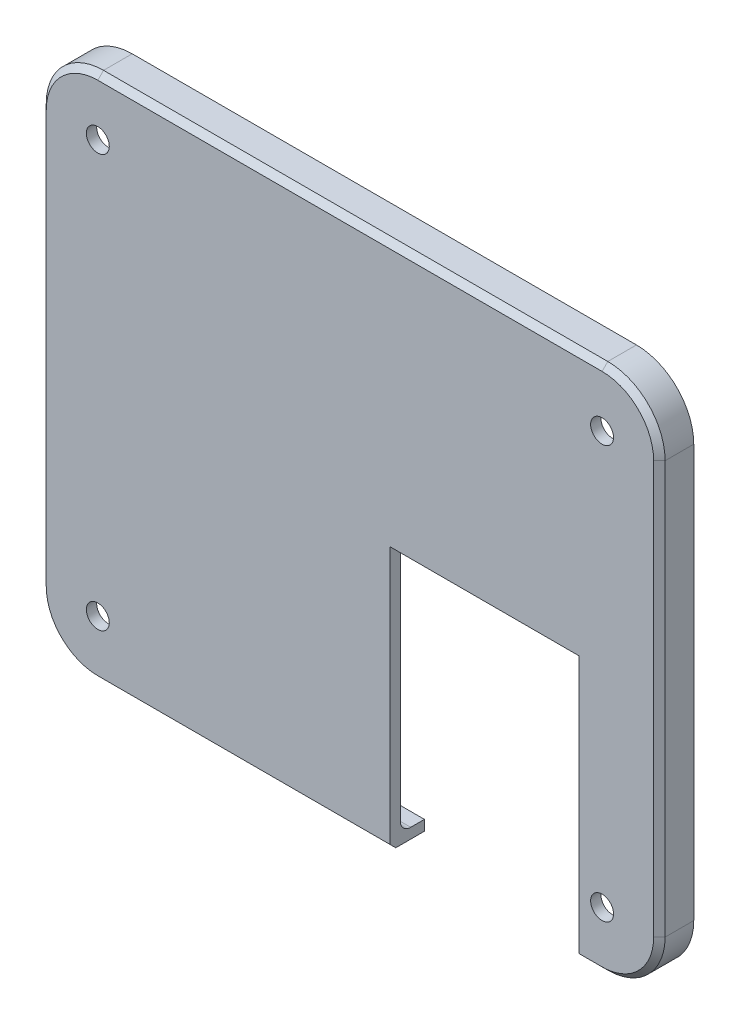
ISO-10303-21;
HEADER;
FILE_DESCRIPTION(('STEP AP214'),'2;1');
FILE_NAME('part.step','',(''),(''),'','','');
FILE_SCHEMA(('AUTOMOTIVE_DESIGN { 1 0 10303 214 1 1 1 1 }'));
ENDSEC;
DATA;
#1=APPLICATION_CONTEXT('core data for automotive mechanical design processes');
#2=APPLICATION_PROTOCOL_DEFINITION('international standard','automotive_design',2000,#1);
#3=PRODUCT_CONTEXT('',#1,'mechanical');
#4=PRODUCT('Part','Part','',(#3));
#5=PRODUCT_RELATED_PRODUCT_CATEGORY('part','',(#4));
#6=PRODUCT_DEFINITION_FORMATION('','',#4);
#7=PRODUCT_DEFINITION_CONTEXT('part definition',#1,'design');
#8=PRODUCT_DEFINITION('design','',#6,#7);
#9=PRODUCT_DEFINITION_SHAPE('','',#8);
#10=(LENGTH_UNIT() NAMED_UNIT(*) SI_UNIT(.MILLI.,.METRE.));
#11=(NAMED_UNIT(*) PLANE_ANGLE_UNIT() SI_UNIT($,.RADIAN.));
#12=(NAMED_UNIT(*) SI_UNIT($,.STERADIAN.) SOLID_ANGLE_UNIT());
#13=UNCERTAINTY_MEASURE_WITH_UNIT(LENGTH_MEASURE(1.E-05),#10,'distance_accuracy_value','');
#14=(GEOMETRIC_REPRESENTATION_CONTEXT(3) GLOBAL_UNCERTAINTY_ASSIGNED_CONTEXT((#13)) GLOBAL_UNIT_ASSIGNED_CONTEXT((#10,
#11,#12)) REPRESENTATION_CONTEXT('',''));
#15=CARTESIAN_POINT('',(0.,0.,0.));
#16=DIRECTION('',(0.,0.,1.));
#17=DIRECTION('',(1.,0.,0.));
#18=AXIS2_PLACEMENT_3D('',#15,#16,#17);
#19=CARTESIAN_POINT('',(44.0000000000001,-46.,6.));
#20=DIRECTION('',(0.,1.,0.));
#21=DIRECTION('',(0.,0.,1.));
#22=AXIS2_PLACEMENT_3D('',#19,#20,#21);
#23=PLANE('',#22);
#24=DIRECTION('',(0.,0.,1.));
#25=VECTOR('',#24,1.);
#26=CARTESIAN_POINT('',(7.00000000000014,-46.,0.));
#27=LINE('',#26,#25);
#28=CARTESIAN_POINT('',(7.00000000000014,-46.,0.));
#29=VERTEX_POINT('',#28);
#30=CARTESIAN_POINT('',(7.00000000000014,-46.,5.));
#31=VERTEX_POINT('',#30);
#32=EDGE_CURVE('E243',#29,#31,#27,.T.);
#33=ORIENTED_EDGE('',*,*,#32,.T.);
#34=DIRECTION('',(-1.,0.,0.));
#35=VECTOR('',#34,1.);
#36=CARTESIAN_POINT('',(-44.0000000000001,-46.,5.));
#37=LINE('',#36,#35);
#38=CARTESIAN_POINT('',(-44.0000000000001,-46.,5.));
#39=VERTEX_POINT('',#38);
#40=EDGE_CURVE('E343',#31,#39,#37,.T.);
#41=ORIENTED_EDGE('',*,*,#40,.T.);
#42=DIRECTION('',(0.,0.,-1.));
#43=VECTOR('',#42,1.);
#44=CARTESIAN_POINT('',(-44.0000000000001,-46.,6.));
#45=LINE('',#44,#43);
#46=CARTESIAN_POINT('',(-44.0000000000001,-46.,0.));
#47=VERTEX_POINT('',#46);
#48=EDGE_CURVE('E271',#39,#47,#45,.T.);
#49=ORIENTED_EDGE('',*,*,#48,.T.);
#50=DIRECTION('',(1.,0.,0.));
#51=VECTOR('',#50,1.);
#52=CARTESIAN_POINT('',(44.0000000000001,-46.,0.));
#53=LINE('',#52,#51);
#54=EDGE_CURVE('E263',#47,#29,#53,.T.);
#55=ORIENTED_EDGE('',*,*,#54,.T.);
#56=EDGE_LOOP('',(#33,#41,#49,#55));
#57=FACE_BOUND('',#56,.T.);
#58=ADVANCED_FACE('F33',(#57),#23,.F.);
#59=CARTESIAN_POINT('',(44.0000000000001,-44.2,6.));
#60=DIRECTION('',(0.,1.,0.));
#61=DIRECTION('',(0.,0.,1.));
#62=AXIS2_PLACEMENT_3D('',#59,#60,#61);
#63=PLANE('',#62);
#64=DIRECTION('',(0.,0.,1.));
#65=VECTOR('',#64,1.);
#66=CARTESIAN_POINT('',(-44.0000000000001,-44.2,6.));
#67=LINE('',#66,#65);
#68=CARTESIAN_POINT('',(-44.0000000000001,-44.2,2.4));
#69=VERTEX_POINT('',#68);
#70=CARTESIAN_POINT('',(-44.0000000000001,-44.2,0.));
#71=VERTEX_POINT('',#70);
#72=EDGE_CURVE('E454',#69,#71,#67,.F.);
#73=ORIENTED_EDGE('',*,*,#72,.F.);
#74=DIRECTION('',(1.,0.,0.));
#75=VECTOR('',#74,1.);
#76=CARTESIAN_POINT('',(44.0000000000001,-44.2,2.4));
#77=LINE('',#76,#75);
#78=CARTESIAN_POINT('',(7.00000000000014,-44.2,2.4));
#79=VERTEX_POINT('',#78);
#80=EDGE_CURVE('E410',#69,#79,#77,.T.);
#81=ORIENTED_EDGE('',*,*,#80,.T.);
#82=DIRECTION('',(0.,0.,1.));
#83=VECTOR('',#82,1.);
#84=CARTESIAN_POINT('',(7.00000000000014,-44.2,6.));
#85=LINE('',#84,#83);
#86=CARTESIAN_POINT('',(7.00000000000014,-44.2,0.));
#87=VERTEX_POINT('',#86);
#88=EDGE_CURVE('E314',#87,#79,#85,.T.);
#89=ORIENTED_EDGE('',*,*,#88,.F.);
#90=DIRECTION('',(1.,0.,0.));
#91=VECTOR('',#90,1.);
#92=CARTESIAN_POINT('',(44.0000000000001,-44.2,0.));
#93=LINE('',#92,#91);
#94=EDGE_CURVE('E267',#71,#87,#93,.T.);
#95=ORIENTED_EDGE('',*,*,#94,.F.);
#96=EDGE_LOOP('',(#73,#81,#89,#95));
#97=FACE_BOUND('',#96,.T.);
#98=ADVANCED_FACE('F453',(#97),#63,.T.);
#99=CARTESIAN_POINT('',(-44.0000000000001,-36.,6.));
#100=DIRECTION('',(0.,0.,1.));
#101=DIRECTION('',(1.,0.,0.));
#102=AXIS2_PLACEMENT_3D('',#99,#100,#101);
#103=PLANE('',#102);
#104=DIRECTION('',(0.,1.,0.));
#105=VECTOR('',#104,1.);
#106=CARTESIAN_POINT('',(40.0000000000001,-46.,6.));
#107=LINE('',#106,#105);
#108=CARTESIAN_POINT('',(40.0000000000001,-45.,6.));
#109=VERTEX_POINT('',#108);
#110=CARTESIAN_POINT('',(40.0000000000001,0.,6.));
#111=VERTEX_POINT('',#110);
#112=EDGE_CURVE('E585',#109,#111,#107,.T.);
#113=ORIENTED_EDGE('',*,*,#112,.F.);
#114=DIRECTION('',(1.,0.,0.));
#115=VECTOR('',#114,1.);
#116=CARTESIAN_POINT('',(44.0000000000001,-45.,6.));
#117=LINE('',#116,#115);
#118=CARTESIAN_POINT('',(44.0000000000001,-45.,6.));
#119=VERTEX_POINT('',#118);
#120=EDGE_CURVE('E335',#109,#119,#117,.T.);
#121=ORIENTED_EDGE('',*,*,#120,.T.);
#122=CARTESIAN_POINT('',(44.0000000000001,-36.,6.));
#123=DIRECTION('',(0.,0.,1.));
#124=DIRECTION('',(1.,0.,0.));
#125=AXIS2_PLACEMENT_3D('',#122,#123,#124);
#126=CIRCLE('',#125,9.);
#127=CARTESIAN_POINT('',(53.0000000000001,-36.,6.));
#128=VERTEX_POINT('',#127);
#129=EDGE_CURVE('E331',#119,#128,#126,.T.);
#130=ORIENTED_EDGE('',*,*,#129,.T.);
#131=DIRECTION('',(0.,1.,0.));
#132=VECTOR('',#131,1.);
#133=CARTESIAN_POINT('',(53.0000000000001,36.,6.));
#134=LINE('',#133,#132);
#135=CARTESIAN_POINT('',(53.0000000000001,36.,6.));
#136=VERTEX_POINT('',#135);
#137=EDGE_CURVE('E327',#128,#136,#134,.T.);
#138=ORIENTED_EDGE('',*,*,#137,.T.);
#139=CARTESIAN_POINT('',(44.0000000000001,36.,6.));
#140=DIRECTION('',(0.,0.,1.));
#141=DIRECTION('',(1.,0.,0.));
#142=AXIS2_PLACEMENT_3D('',#139,#140,#141);
#143=CIRCLE('',#142,8.99999999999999);
#144=CARTESIAN_POINT('',(44.0000000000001,45.,6.));
#145=VERTEX_POINT('',#144);
#146=EDGE_CURVE('E323',#136,#145,#143,.T.);
#147=ORIENTED_EDGE('',*,*,#146,.T.);
#148=DIRECTION('',(-1.,0.,0.));
#149=VECTOR('',#148,1.);
#150=CARTESIAN_POINT('',(-44.0000000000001,45.,6.));
#151=LINE('',#150,#149);
#152=CARTESIAN_POINT('',(-44.0000000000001,45.,6.));
#153=VERTEX_POINT('',#152);
#154=EDGE_CURVE('E319',#145,#153,#151,.T.);
#155=ORIENTED_EDGE('',*,*,#154,.T.);
#156=CARTESIAN_POINT('',(-44.0000000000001,36.,6.));
#157=DIRECTION('',(0.,0.,1.));
#158=DIRECTION('',(1.,0.,0.));
#159=AXIS2_PLACEMENT_3D('',#156,#157,#158);
#160=CIRCLE('',#159,8.99999999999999);
#161=CARTESIAN_POINT('',(-53.0000000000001,36.,6.));
#162=VERTEX_POINT('',#161);
#163=EDGE_CURVE('E321',#153,#162,#160,.T.);
#164=ORIENTED_EDGE('',*,*,#163,.T.);
#165=DIRECTION('',(0.,-1.,0.));
#166=VECTOR('',#165,1.);
#167=CARTESIAN_POINT('',(-53.0000000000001,-36.,6.));
#168=LINE('',#167,#166);
#169=CARTESIAN_POINT('',(-53.0000000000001,-36.,6.));
#170=VERTEX_POINT('',#169);
#171=EDGE_CURVE('E325',#162,#170,#168,.T.);
#172=ORIENTED_EDGE('',*,*,#171,.T.);
#173=CARTESIAN_POINT('',(-44.0000000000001,-36.,6.));
#174=DIRECTION('',(0.,0.,1.));
#175=DIRECTION('',(1.,0.,0.));
#176=AXIS2_PLACEMENT_3D('',#173,#174,#175);
#177=CIRCLE('',#176,9.);
#178=CARTESIAN_POINT('',(-44.0000000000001,-45.,6.));
#179=VERTEX_POINT('',#178);
#180=EDGE_CURVE('E329',#170,#179,#177,.T.);
#181=ORIENTED_EDGE('',*,*,#180,.T.);
#182=DIRECTION('',(1.,0.,0.));
#183=VECTOR('',#182,1.);
#184=CARTESIAN_POINT('',(7.00000000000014,-45.,6.));
#185=LINE('',#184,#183);
#186=CARTESIAN_POINT('',(7.00000000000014,-45.,6.));
#187=VERTEX_POINT('',#186);
#188=EDGE_CURVE('E333',#179,#187,#185,.T.);
#189=ORIENTED_EDGE('',*,*,#188,.T.);
#190=DIRECTION('',(0.,-1.,0.));
#191=VECTOR('',#190,1.);
#192=CARTESIAN_POINT('',(7.00000000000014,-46.,6.));
#193=LINE('',#192,#191);
#194=CARTESIAN_POINT('',(7.00000000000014,0.,6.));
#195=VERTEX_POINT('',#194);
#196=EDGE_CURVE('E383',#195,#187,#193,.T.);
#197=ORIENTED_EDGE('',*,*,#196,.F.);
#198=DIRECTION('',(-1.,0.,0.));
#199=VECTOR('',#198,1.);
#200=CARTESIAN_POINT('',(7.00000000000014,0.,6.));
#201=LINE('',#200,#199);
#202=EDGE_CURVE('E268',#111,#195,#201,.T.);
#203=ORIENTED_EDGE('',*,*,#202,.F.);
#204=EDGE_LOOP('',(#113,#121,#130,#138,#147,#155,#164,#172,#181,#189,#197,#203));
#205=FACE_BOUND('',#204,.T.);
#206=CARTESIAN_POINT('',(43.9999999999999,36.,6.));
#207=DIRECTION('',(0.,0.,1.));
#208=DIRECTION('',(1.,0.,0.));
#209=AXIS2_PLACEMENT_3D('',#206,#207,#208);
#210=CIRCLE('',#209,2.);
#211=CARTESIAN_POINT('',(45.9999999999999,36.,6.));
#212=VERTEX_POINT('',#211);
#213=EDGE_CURVE('E519',#212,#212,#210,.T.);
#214=ORIENTED_EDGE('',*,*,#213,.F.);
#215=EDGE_LOOP('',(#214));
#216=FACE_BOUND('',#215,.T.);
#217=CARTESIAN_POINT('',(-43.9999999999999,-36.,6.));
#218=DIRECTION('',(0.,0.,1.));
#219=DIRECTION('',(1.,0.,0.));
#220=AXIS2_PLACEMENT_3D('',#217,#218,#219);
#221=CIRCLE('',#220,2.);
#222=CARTESIAN_POINT('',(-41.9999999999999,-36.,6.));
#223=VERTEX_POINT('',#222);
#224=EDGE_CURVE('E524',#223,#223,#221,.T.);
#225=ORIENTED_EDGE('',*,*,#224,.F.);
#226=EDGE_LOOP('',(#225));
#227=FACE_BOUND('',#226,.T.);
#228=CARTESIAN_POINT('',(44.0000000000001,-36.,6.));
#229=DIRECTION('',(0.,0.,1.));
#230=DIRECTION('',(1.,0.,0.));
#231=AXIS2_PLACEMENT_3D('',#228,#229,#230);
#232=CIRCLE('',#231,2.);
#233=CARTESIAN_POINT('',(46.0000000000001,-36.,6.));
#234=VERTEX_POINT('',#233);
#235=EDGE_CURVE('E522',#234,#234,#232,.T.);
#236=ORIENTED_EDGE('',*,*,#235,.F.);
#237=EDGE_LOOP('',(#236));
#238=FACE_BOUND('',#237,.T.);
#239=CARTESIAN_POINT('',(-44.0000000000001,36.,6.));
#240=DIRECTION('',(0.,0.,1.));
#241=DIRECTION('',(1.,0.,0.));
#242=AXIS2_PLACEMENT_3D('',#239,#240,#241);
#243=CIRCLE('',#242,2.);
#244=CARTESIAN_POINT('',(-42.0000000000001,36.,6.));
#245=VERTEX_POINT('',#244);
#246=EDGE_CURVE('E472',#245,#245,#243,.T.);
#247=ORIENTED_EDGE('',*,*,#246,.F.);
#248=EDGE_LOOP('',(#247));
#249=FACE_BOUND('',#248,.T.);
#250=ADVANCED_FACE('F625',(#205,#216,#227,#238,#249),#103,.T.);
#251=CARTESIAN_POINT('',(-44.0000000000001,-36.,0.));
#252=DIRECTION('',(0.,0.,1.));
#253=DIRECTION('',(1.,0.,0.));
#254=AXIS2_PLACEMENT_3D('',#251,#252,#253);
#255=PLANE('',#254);
#256=ORIENTED_EDGE('',*,*,#94,.T.);
#257=DIRECTION('',(0.,-1.,0.));
#258=VECTOR('',#257,1.);
#259=CARTESIAN_POINT('',(7.00000000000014,-46.,0.));
#260=LINE('',#259,#258);
#261=EDGE_CURVE('E248',#87,#29,#260,.T.);
#262=ORIENTED_EDGE('',*,*,#261,.T.);
#263=ORIENTED_EDGE('',*,*,#54,.F.);
#264=CARTESIAN_POINT('',(-44.0000000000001,-36.,0.));
#265=DIRECTION('',(0.,0.,1.));
#266=DIRECTION('',(1.,0.,0.));
#267=AXIS2_PLACEMENT_3D('',#264,#265,#266);
#268=CIRCLE('',#267,10.);
#269=CARTESIAN_POINT('',(-54.0000000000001,-36.,0.));
#270=VERTEX_POINT('',#269);
#271=EDGE_CURVE('E279',#270,#47,#268,.T.);
#272=ORIENTED_EDGE('',*,*,#271,.F.);
#273=DIRECTION('',(0.,-1.,0.));
#274=VECTOR('',#273,1.);
#275=CARTESIAN_POINT('',(-54.0000000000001,-36.,0.));
#276=LINE('',#275,#274);
#277=CARTESIAN_POINT('',(-54.0000000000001,36.,0.));
#278=VERTEX_POINT('',#277);
#279=EDGE_CURVE('E294',#278,#270,#276,.T.);
#280=ORIENTED_EDGE('',*,*,#279,.F.);
#281=CARTESIAN_POINT('',(-44.0000000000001,36.,0.));
#282=DIRECTION('',(0.,0.,1.));
#283=DIRECTION('',(1.,0.,0.));
#284=AXIS2_PLACEMENT_3D('',#281,#282,#283);
#285=CIRCLE('',#284,10.);
#286=CARTESIAN_POINT('',(-44.0000000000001,46.,0.));
#287=VERTEX_POINT('',#286);
#288=EDGE_CURVE('E291',#287,#278,#285,.T.);
#289=ORIENTED_EDGE('',*,*,#288,.F.);
#290=DIRECTION('',(-1.,0.,0.));
#291=VECTOR('',#290,1.);
#292=CARTESIAN_POINT('',(44.0000000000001,46.,0.));
#293=LINE('',#292,#291);
#294=CARTESIAN_POINT('',(44.0000000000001,46.,0.));
#295=VERTEX_POINT('',#294);
#296=EDGE_CURVE('E288',#295,#287,#293,.T.);
#297=ORIENTED_EDGE('',*,*,#296,.F.);
#298=CARTESIAN_POINT('',(44.0000000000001,36.,0.));
#299=DIRECTION('',(0.,0.,1.));
#300=DIRECTION('',(1.,0.,0.));
#301=AXIS2_PLACEMENT_3D('',#298,#299,#300);
#302=CIRCLE('',#301,10.);
#303=CARTESIAN_POINT('',(54.0000000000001,36.,0.));
#304=VERTEX_POINT('',#303);
#305=EDGE_CURVE('E285',#304,#295,#302,.T.);
#306=ORIENTED_EDGE('',*,*,#305,.F.);
#307=DIRECTION('',(0.,1.,0.));
#308=VECTOR('',#307,1.);
#309=CARTESIAN_POINT('',(54.0000000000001,-36.,0.));
#310=LINE('',#309,#308);
#311=CARTESIAN_POINT('',(54.0000000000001,-36.,0.));
#312=VERTEX_POINT('',#311);
#313=EDGE_CURVE('E276',#312,#304,#310,.T.);
#314=ORIENTED_EDGE('',*,*,#313,.F.);
#315=CARTESIAN_POINT('',(44.0000000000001,-36.,0.));
#316=DIRECTION('',(0.,0.,1.));
#317=DIRECTION('',(1.,0.,0.));
#318=AXIS2_PLACEMENT_3D('',#315,#316,#317);
#319=CIRCLE('',#318,10.);
#320=CARTESIAN_POINT('',(44.0000000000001,-46.,0.));
#321=VERTEX_POINT('',#320);
#322=EDGE_CURVE('E272',#321,#312,#319,.T.);
#323=ORIENTED_EDGE('',*,*,#322,.F.);
#324=CARTESIAN_POINT('',(40.0000000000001,-46.,0.));
#325=VERTEX_POINT('',#324);
#326=EDGE_CURVE('E273',#325,#321,#53,.T.);
#327=ORIENTED_EDGE('',*,*,#326,.F.);
#328=DIRECTION('',(0.,1.,0.));
#329=VECTOR('',#328,1.);
#330=CARTESIAN_POINT('',(40.0000000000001,-46.,0.));
#331=LINE('',#330,#329);
#332=CARTESIAN_POINT('',(40.0000000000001,-44.2,0.));
#333=VERTEX_POINT('',#332);
#334=EDGE_CURVE('E256',#325,#333,#331,.T.);
#335=ORIENTED_EDGE('',*,*,#334,.T.);
#336=CARTESIAN_POINT('',(44.0000000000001,-44.2,0.));
#337=VERTEX_POINT('',#336);
#338=EDGE_CURVE('E498',#333,#337,#93,.T.);
#339=ORIENTED_EDGE('',*,*,#338,.T.);
#340=CARTESIAN_POINT('',(44.0000000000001,-36.,0.));
#341=DIRECTION('',(0.,0.,1.));
#342=DIRECTION('',(1.,0.,0.));
#343=AXIS2_PLACEMENT_3D('',#340,#341,#342);
#344=CIRCLE('',#343,8.2);
#345=CARTESIAN_POINT('',(52.2000000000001,-36.,0.));
#346=VERTEX_POINT('',#345);
#347=EDGE_CURVE('E513',#337,#346,#344,.T.);
#348=ORIENTED_EDGE('',*,*,#347,.T.);
#349=DIRECTION('',(0.,1.,0.));
#350=VECTOR('',#349,1.);
#351=CARTESIAN_POINT('',(52.2000000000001,-36.,0.));
#352=LINE('',#351,#350);
#353=CARTESIAN_POINT('',(52.2000000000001,36.,0.));
#354=VERTEX_POINT('',#353);
#355=EDGE_CURVE('E510',#346,#354,#352,.T.);
#356=ORIENTED_EDGE('',*,*,#355,.T.);
#357=CARTESIAN_POINT('',(44.0000000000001,36.,0.));
#358=DIRECTION('',(0.,0.,1.));
#359=DIRECTION('',(1.,0.,0.));
#360=AXIS2_PLACEMENT_3D('',#357,#358,#359);
#361=CIRCLE('',#360,8.2);
#362=CARTESIAN_POINT('',(44.0000000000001,44.2,0.));
#363=VERTEX_POINT('',#362);
#364=EDGE_CURVE('E507',#354,#363,#361,.T.);
#365=ORIENTED_EDGE('',*,*,#364,.T.);
#366=DIRECTION('',(-1.,0.,0.));
#367=VECTOR('',#366,1.);
#368=CARTESIAN_POINT('',(44.0000000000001,44.2,0.));
#369=LINE('',#368,#367);
#370=CARTESIAN_POINT('',(-44.0000000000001,44.2,0.));
#371=VERTEX_POINT('',#370);
#372=EDGE_CURVE('E504',#363,#371,#369,.T.);
#373=ORIENTED_EDGE('',*,*,#372,.T.);
#374=CARTESIAN_POINT('',(-44.0000000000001,36.,0.));
#375=DIRECTION('',(0.,0.,1.));
#376=DIRECTION('',(1.,0.,0.));
#377=AXIS2_PLACEMENT_3D('',#374,#375,#376);
#378=CIRCLE('',#377,8.2);
#379=CARTESIAN_POINT('',(-52.2000000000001,36.,0.));
#380=VERTEX_POINT('',#379);
#381=EDGE_CURVE('E501',#371,#380,#378,.T.);
#382=ORIENTED_EDGE('',*,*,#381,.T.);
#383=DIRECTION('',(0.,-1.,0.));
#384=VECTOR('',#383,1.);
#385=CARTESIAN_POINT('',(-52.2000000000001,-36.,0.));
#386=LINE('',#385,#384);
#387=CARTESIAN_POINT('',(-52.2000000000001,-36.,0.));
#388=VERTEX_POINT('',#387);
#389=EDGE_CURVE('E477',#380,#388,#386,.T.);
#390=ORIENTED_EDGE('',*,*,#389,.T.);
#391=CARTESIAN_POINT('',(-44.0000000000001,-36.,0.));
#392=DIRECTION('',(0.,0.,1.));
#393=DIRECTION('',(1.,0.,0.));
#394=AXIS2_PLACEMENT_3D('',#391,#392,#393);
#395=CIRCLE('',#394,8.20000000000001);
#396=EDGE_CURVE('E494',#388,#71,#395,.T.);
#397=ORIENTED_EDGE('',*,*,#396,.T.);
#398=EDGE_LOOP('',(#256,#262,#263,#272,#280,#289,#297,#306,#314,#323,#327,#335,#339,#348,#356,
#365,#373,#382,#390,#397));
#399=FACE_BOUND('',#398,.T.);
#400=ADVANCED_FACE('F261',(#399),#255,.F.);
#401=CARTESIAN_POINT('',(-44.0000000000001,-36.,6.));
#402=DIRECTION('',(0.,0.,-1.));
#403=DIRECTION('',(-1.,0.,0.));
#404=AXIS2_PLACEMENT_3D('',#401,#402,#403);
#405=CYLINDRICAL_SURFACE('',#404,10.);
#406=ORIENTED_EDGE('',*,*,#48,.F.);
#407=CARTESIAN_POINT('',(-44.0000000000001,-36.,5.));
#408=DIRECTION('',(0.,0.,1.));
#409=DIRECTION('',(1.,0.,0.));
#410=AXIS2_PLACEMENT_3D('',#407,#408,#409);
#411=CIRCLE('',#410,10.);
#412=CARTESIAN_POINT('',(-54.0000000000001,-36.,5.));
#413=VERTEX_POINT('',#412);
#414=EDGE_CURVE('E347',#39,#413,#411,.F.);
#415=ORIENTED_EDGE('',*,*,#414,.T.);
#416=DIRECTION('',(0.,0.,-1.));
#417=VECTOR('',#416,1.);
#418=CARTESIAN_POINT('',(-54.0000000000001,-36.,6.));
#419=LINE('',#418,#417);
#420=EDGE_CURVE('E297',#413,#270,#419,.T.);
#421=ORIENTED_EDGE('',*,*,#420,.T.);
#422=ORIENTED_EDGE('',*,*,#271,.T.);
#423=EDGE_LOOP('',(#406,#415,#421,#422));
#424=FACE_BOUND('',#423,.T.);
#425=ADVANCED_FACE('F529',(#424),#405,.T.);
#426=DIRECTION('',(0.,0.,-1.));
#427=VECTOR('',#426,1.);
#428=CARTESIAN_POINT('',(44.0000000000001,-46.,6.));
#429=LINE('',#428,#427);
#430=CARTESIAN_POINT('',(44.0000000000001,-46.,5.));
#431=VERTEX_POINT('',#430);
#432=EDGE_CURVE('E309',#431,#321,#429,.T.);
#433=ORIENTED_EDGE('',*,*,#432,.F.);
#434=DIRECTION('',(-1.,0.,0.));
#435=VECTOR('',#434,1.);
#436=CARTESIAN_POINT('',(40.0000000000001,-46.,5.));
#437=LINE('',#436,#435);
#438=CARTESIAN_POINT('',(40.0000000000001,-46.,5.));
#439=VERTEX_POINT('',#438);
#440=EDGE_CURVE('E338',#431,#439,#437,.T.);
#441=ORIENTED_EDGE('',*,*,#440,.T.);
#442=DIRECTION('',(0.,0.,1.));
#443=VECTOR('',#442,1.);
#444=CARTESIAN_POINT('',(40.0000000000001,-46.,0.));
#445=LINE('',#444,#443);
#446=EDGE_CURVE('E255',#325,#439,#445,.T.);
#447=ORIENTED_EDGE('',*,*,#446,.F.);
#448=ORIENTED_EDGE('',*,*,#326,.T.);
#449=EDGE_LOOP('',(#433,#441,#447,#448));
#450=FACE_BOUND('',#449,.T.);
#451=ADVANCED_FACE('F572',(#450),#23,.F.);
#452=CARTESIAN_POINT('',(44.0000000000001,-36.,6.));
#453=DIRECTION('',(0.,0.,-1.));
#454=DIRECTION('',(-1.,0.,0.));
#455=AXIS2_PLACEMENT_3D('',#452,#453,#454);
#456=CYLINDRICAL_SURFACE('',#455,10.);
#457=DIRECTION('',(0.,0.,-1.));
#458=VECTOR('',#457,1.);
#459=CARTESIAN_POINT('',(54.0000000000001,-36.,6.));
#460=LINE('',#459,#458);
#461=CARTESIAN_POINT('',(54.0000000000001,-36.,5.));
#462=VERTEX_POINT('',#461);
#463=EDGE_CURVE('E307',#462,#312,#460,.T.);
#464=ORIENTED_EDGE('',*,*,#463,.F.);
#465=CARTESIAN_POINT('',(44.0000000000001,-36.,5.));
#466=DIRECTION('',(0.,0.,1.));
#467=DIRECTION('',(1.,0.,0.));
#468=AXIS2_PLACEMENT_3D('',#465,#466,#467);
#469=CIRCLE('',#468,10.);
#470=EDGE_CURVE('E345',#462,#431,#469,.F.);
#471=ORIENTED_EDGE('',*,*,#470,.T.);
#472=ORIENTED_EDGE('',*,*,#432,.T.);
#473=ORIENTED_EDGE('',*,*,#322,.T.);
#474=EDGE_LOOP('',(#464,#471,#472,#473));
#475=FACE_BOUND('',#474,.T.);
#476=ADVANCED_FACE('F564',(#475),#456,.T.);
#477=CARTESIAN_POINT('',(54.0000000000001,-36.,6.));
#478=DIRECTION('',(-1.,0.,0.));
#479=DIRECTION('',(0.,0.,1.));
#480=AXIS2_PLACEMENT_3D('',#477,#478,#479);
#481=PLANE('',#480);
#482=DIRECTION('',(0.,0.,-1.));
#483=VECTOR('',#482,1.);
#484=CARTESIAN_POINT('',(54.0000000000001,36.,6.));
#485=LINE('',#484,#483);
#486=CARTESIAN_POINT('',(54.0000000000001,36.,5.));
#487=VERTEX_POINT('',#486);
#488=EDGE_CURVE('E305',#487,#304,#485,.T.);
#489=ORIENTED_EDGE('',*,*,#488,.F.);
#490=DIRECTION('',(0.,-1.,0.));
#491=VECTOR('',#490,1.);
#492=CARTESIAN_POINT('',(54.0000000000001,-36.,5.));
#493=LINE('',#492,#491);
#494=EDGE_CURVE('E349',#487,#462,#493,.T.);
#495=ORIENTED_EDGE('',*,*,#494,.T.);
#496=ORIENTED_EDGE('',*,*,#463,.T.);
#497=ORIENTED_EDGE('',*,*,#313,.T.);
#498=EDGE_LOOP('',(#489,#495,#496,#497));
#499=FACE_BOUND('',#498,.T.);
#500=ADVANCED_FACE('F559',(#499),#481,.F.);
#501=CARTESIAN_POINT('',(44.0000000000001,36.,6.));
#502=DIRECTION('',(0.,0.,-1.));
#503=DIRECTION('',(-1.,0.,0.));
#504=AXIS2_PLACEMENT_3D('',#501,#502,#503);
#505=CYLINDRICAL_SURFACE('',#504,10.);
#506=DIRECTION('',(0.,0.,-1.));
#507=VECTOR('',#506,1.);
#508=CARTESIAN_POINT('',(44.0000000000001,46.,6.));
#509=LINE('',#508,#507);
#510=CARTESIAN_POINT('',(44.0000000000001,46.,5.));
#511=VERTEX_POINT('',#510);
#512=EDGE_CURVE('E303',#511,#295,#509,.T.);
#513=ORIENTED_EDGE('',*,*,#512,.F.);
#514=CARTESIAN_POINT('',(44.0000000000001,36.,5.));
#515=DIRECTION('',(0.,0.,1.));
#516=DIRECTION('',(1.,0.,0.));
#517=AXIS2_PLACEMENT_3D('',#514,#515,#516);
#518=CIRCLE('',#517,10.);
#519=EDGE_CURVE('E353',#511,#487,#518,.F.);
#520=ORIENTED_EDGE('',*,*,#519,.T.);
#521=ORIENTED_EDGE('',*,*,#488,.T.);
#522=ORIENTED_EDGE('',*,*,#305,.T.);
#523=EDGE_LOOP('',(#513,#520,#521,#522));
#524=FACE_BOUND('',#523,.T.);
#525=ADVANCED_FACE('F553',(#524),#505,.T.);
#526=CARTESIAN_POINT('',(44.0000000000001,46.,6.));
#527=DIRECTION('',(0.,-1.,0.));
#528=DIRECTION('',(0.,0.,-1.));
#529=AXIS2_PLACEMENT_3D('',#526,#527,#528);
#530=PLANE('',#529);
#531=DIRECTION('',(0.,0.,-1.));
#532=VECTOR('',#531,1.);
#533=CARTESIAN_POINT('',(-44.0000000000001,46.,6.));
#534=LINE('',#533,#532);
#535=CARTESIAN_POINT('',(-44.0000000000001,46.,5.));
#536=VERTEX_POINT('',#535);
#537=EDGE_CURVE('E301',#536,#287,#534,.T.);
#538=ORIENTED_EDGE('',*,*,#537,.F.);
#539=DIRECTION('',(1.,0.,0.));
#540=VECTOR('',#539,1.);
#541=CARTESIAN_POINT('',(44.0000000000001,46.,5.));
#542=LINE('',#541,#540);
#543=EDGE_CURVE('E357',#536,#511,#542,.T.);
#544=ORIENTED_EDGE('',*,*,#543,.T.);
#545=ORIENTED_EDGE('',*,*,#512,.T.);
#546=ORIENTED_EDGE('',*,*,#296,.T.);
#547=EDGE_LOOP('',(#538,#544,#545,#546));
#548=FACE_BOUND('',#547,.T.);
#549=ADVANCED_FACE('F547',(#548),#530,.F.);
#550=CARTESIAN_POINT('',(-44.0000000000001,36.,6.));
#551=DIRECTION('',(0.,0.,-1.));
#552=DIRECTION('',(-1.,0.,0.));
#553=AXIS2_PLACEMENT_3D('',#550,#551,#552);
#554=CYLINDRICAL_SURFACE('',#553,10.);
#555=DIRECTION('',(0.,0.,-1.));
#556=VECTOR('',#555,1.);
#557=CARTESIAN_POINT('',(-54.0000000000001,36.,6.));
#558=LINE('',#557,#556);
#559=CARTESIAN_POINT('',(-54.0000000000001,36.,5.));
#560=VERTEX_POINT('',#559);
#561=EDGE_CURVE('E299',#560,#278,#558,.T.);
#562=ORIENTED_EDGE('',*,*,#561,.F.);
#563=CARTESIAN_POINT('',(-44.0000000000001,36.,5.));
#564=DIRECTION('',(0.,0.,1.));
#565=DIRECTION('',(1.,0.,0.));
#566=AXIS2_PLACEMENT_3D('',#563,#564,#565);
#567=CIRCLE('',#566,10.);
#568=EDGE_CURVE('E355',#560,#536,#567,.F.);
#569=ORIENTED_EDGE('',*,*,#568,.T.);
#570=ORIENTED_EDGE('',*,*,#537,.T.);
#571=ORIENTED_EDGE('',*,*,#288,.T.);
#572=EDGE_LOOP('',(#562,#569,#570,#571));
#573=FACE_BOUND('',#572,.T.);
#574=ADVANCED_FACE('F542',(#573),#554,.T.);
#575=CARTESIAN_POINT('',(-54.0000000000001,-36.,6.));
#576=DIRECTION('',(1.,0.,0.));
#577=DIRECTION('',(0.,1.,0.));
#578=AXIS2_PLACEMENT_3D('',#575,#576,#577);
#579=PLANE('',#578);
#580=ORIENTED_EDGE('',*,*,#420,.F.);
#581=DIRECTION('',(0.,1.,0.));
#582=VECTOR('',#581,1.);
#583=CARTESIAN_POINT('',(-54.0000000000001,36.,5.));
#584=LINE('',#583,#582);
#585=EDGE_CURVE('E351',#413,#560,#584,.T.);
#586=ORIENTED_EDGE('',*,*,#585,.T.);
#587=ORIENTED_EDGE('',*,*,#561,.T.);
#588=ORIENTED_EDGE('',*,*,#279,.T.);
#589=EDGE_LOOP('',(#580,#586,#587,#588));
#590=FACE_BOUND('',#589,.T.);
#591=ADVANCED_FACE('F536',(#590),#579,.F.);
#592=CARTESIAN_POINT('',(-43.9999999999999,-36.,6.));
#593=DIRECTION('',(0.,0.,-1.));
#594=DIRECTION('',(-1.,0.,0.));
#595=AXIS2_PLACEMENT_3D('',#592,#593,#594);
#596=CYLINDRICAL_SURFACE('',#595,2.);
#597=CARTESIAN_POINT('',(-43.9999999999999,-36.,4.2));
#598=DIRECTION('',(0.,0.,1.));
#599=DIRECTION('',(1.,0.,0.));
#600=AXIS2_PLACEMENT_3D('',#597,#598,#599);
#601=CIRCLE('',#600,2.);
#602=CARTESIAN_POINT('',(-41.9999999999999,-36.,4.2));
#603=VERTEX_POINT('',#602);
#604=EDGE_CURVE('E491',#603,#603,#601,.T.);
#605=ORIENTED_EDGE('',*,*,#604,.F.);
#606=EDGE_LOOP('',(#605));
#607=FACE_BOUND('',#606,.T.);
#608=ORIENTED_EDGE('',*,*,#224,.T.);
#609=EDGE_LOOP('',(#608));
#610=FACE_BOUND('',#609,.T.);
#611=ADVANCED_FACE('F894',(#607,#610),#596,.F.);
#612=CARTESIAN_POINT('',(44.0000000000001,-36.,6.));
#613=DIRECTION('',(0.,0.,-1.));
#614=DIRECTION('',(-1.,0.,0.));
#615=AXIS2_PLACEMENT_3D('',#612,#613,#614);
#616=CYLINDRICAL_SURFACE('',#615,2.);
#617=CARTESIAN_POINT('',(44.0000000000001,-36.,4.2));
#618=DIRECTION('',(0.,0.,1.));
#619=DIRECTION('',(1.,0.,0.));
#620=AXIS2_PLACEMENT_3D('',#617,#618,#619);
#621=CIRCLE('',#620,2.);
#622=CARTESIAN_POINT('',(46.0000000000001,-36.,4.2));
#623=VERTEX_POINT('',#622);
#624=EDGE_CURVE('E490',#623,#623,#621,.T.);
#625=ORIENTED_EDGE('',*,*,#624,.F.);
#626=EDGE_LOOP('',(#625));
#627=FACE_BOUND('',#626,.T.);
#628=ORIENTED_EDGE('',*,*,#235,.T.);
#629=EDGE_LOOP('',(#628));
#630=FACE_BOUND('',#629,.T.);
#631=ADVANCED_FACE('F884',(#627,#630),#616,.F.);
#632=CARTESIAN_POINT('',(43.9999999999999,36.,6.));
#633=DIRECTION('',(0.,0.,-1.));
#634=DIRECTION('',(-1.,0.,0.));
#635=AXIS2_PLACEMENT_3D('',#632,#633,#634);
#636=CYLINDRICAL_SURFACE('',#635,2.);
#637=CARTESIAN_POINT('',(43.9999999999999,36.,4.2));
#638=DIRECTION('',(0.,0.,1.));
#639=DIRECTION('',(1.,0.,0.));
#640=AXIS2_PLACEMENT_3D('',#637,#638,#639);
#641=CIRCLE('',#640,2.);
#642=CARTESIAN_POINT('',(45.9999999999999,36.,4.2));
#643=VERTEX_POINT('',#642);
#644=EDGE_CURVE('E466',#643,#643,#641,.T.);
#645=ORIENTED_EDGE('',*,*,#644,.F.);
#646=EDGE_LOOP('',(#645));
#647=FACE_BOUND('',#646,.T.);
#648=ORIENTED_EDGE('',*,*,#213,.T.);
#649=EDGE_LOOP('',(#648));
#650=FACE_BOUND('',#649,.T.);
#651=ADVANCED_FACE('F874',(#647,#650),#636,.F.);
#652=CARTESIAN_POINT('',(-44.0000000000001,36.,6.));
#653=DIRECTION('',(0.,0.,-1.));
#654=DIRECTION('',(-1.,0.,0.));
#655=AXIS2_PLACEMENT_3D('',#652,#653,#654);
#656=CYLINDRICAL_SURFACE('',#655,2.);
#657=CARTESIAN_POINT('',(-44.0000000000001,36.,4.2));
#658=DIRECTION('',(0.,0.,1.));
#659=DIRECTION('',(1.,0.,0.));
#660=AXIS2_PLACEMENT_3D('',#657,#658,#659);
#661=CIRCLE('',#660,2.);
#662=CARTESIAN_POINT('',(-42.0000000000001,36.,4.2));
#663=VERTEX_POINT('',#662);
#664=EDGE_CURVE('E462',#663,#663,#661,.T.);
#665=ORIENTED_EDGE('',*,*,#664,.F.);
#666=EDGE_LOOP('',(#665));
#667=FACE_BOUND('',#666,.T.);
#668=ORIENTED_EDGE('',*,*,#246,.T.);
#669=EDGE_LOOP('',(#668));
#670=FACE_BOUND('',#669,.T.);
#671=ADVANCED_FACE('F672',(#667,#670),#656,.F.);
#672=CARTESIAN_POINT('',(-44.0000000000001,-36.,4.2));
#673=DIRECTION('',(0.,0.,1.));
#674=DIRECTION('',(1.,0.,0.));
#675=AXIS2_PLACEMENT_3D('',#672,#673,#674);
#676=PLANE('',#675);
#677=ORIENTED_EDGE('',*,*,#644,.T.);
#678=EDGE_LOOP('',(#677));
#679=FACE_BOUND('',#678,.T.);
#680=ORIENTED_EDGE('',*,*,#604,.T.);
#681=EDGE_LOOP('',(#680));
#682=FACE_BOUND('',#681,.T.);
#683=CARTESIAN_POINT('',(44.0000000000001,-36.,4.2));
#684=DIRECTION('',(0.,0.,1.));
#685=DIRECTION('',(1.,0.,0.));
#686=AXIS2_PLACEMENT_3D('',#683,#684,#685);
#687=CIRCLE('',#686,6.4);
#688=CARTESIAN_POINT('',(50.4000000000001,-36.,4.2));
#689=VERTEX_POINT('',#688);
#690=CARTESIAN_POINT('',(44.0000000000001,-42.4,4.2));
#691=VERTEX_POINT('',#690);
#692=EDGE_CURVE('E400',#689,#691,#687,.F.);
#693=ORIENTED_EDGE('',*,*,#692,.T.);
#694=DIRECTION('',(1.,0.,0.));
#695=VECTOR('',#694,1.);
#696=CARTESIAN_POINT('',(-44.0000000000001,-42.4,4.2));
#697=LINE('',#696,#695);
#698=CARTESIAN_POINT('',(40.0000000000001,-42.4,4.2));
#699=VERTEX_POINT('',#698);
#700=EDGE_CURVE('E402',#691,#699,#697,.F.);
#701=ORIENTED_EDGE('',*,*,#700,.T.);
#702=DIRECTION('',(0.,1.,0.));
#703=VECTOR('',#702,1.);
#704=CARTESIAN_POINT('',(40.0000000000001,-36.,4.2));
#705=LINE('',#704,#703);
#706=CARTESIAN_POINT('',(40.0000000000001,0.,4.2));
#707=VERTEX_POINT('',#706);
#708=EDGE_CURVE('E463',#699,#707,#705,.T.);
#709=ORIENTED_EDGE('',*,*,#708,.T.);
#710=DIRECTION('',(-1.,0.,0.));
#711=VECTOR('',#710,1.);
#712=CARTESIAN_POINT('',(-44.0000000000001,0.,4.2));
#713=LINE('',#712,#711);
#714=CARTESIAN_POINT('',(7.00000000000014,0.,4.2));
#715=VERTEX_POINT('',#714);
#716=EDGE_CURVE('E316',#707,#715,#713,.T.);
#717=ORIENTED_EDGE('',*,*,#716,.T.);
#718=DIRECTION('',(0.,-1.,0.));
#719=VECTOR('',#718,1.);
#720=CARTESIAN_POINT('',(7.00000000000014,-36.,4.2));
#721=LINE('',#720,#719);
#722=CARTESIAN_POINT('',(7.00000000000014,-42.4,4.2));
#723=VERTEX_POINT('',#722);
#724=EDGE_CURVE('E456',#715,#723,#721,.T.);
#725=ORIENTED_EDGE('',*,*,#724,.T.);
#726=DIRECTION('',(1.,0.,0.));
#727=VECTOR('',#726,1.);
#728=CARTESIAN_POINT('',(-44.0000000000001,-42.4,4.2));
#729=LINE('',#728,#727);
#730=CARTESIAN_POINT('',(-44.0000000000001,-42.4,4.2));
#731=VERTEX_POINT('',#730);
#732=EDGE_CURVE('E394',#723,#731,#729,.F.);
#733=ORIENTED_EDGE('',*,*,#732,.T.);
#734=CARTESIAN_POINT('',(-44.0000000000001,-36.,4.2));
#735=DIRECTION('',(0.,0.,1.));
#736=DIRECTION('',(1.,0.,0.));
#737=AXIS2_PLACEMENT_3D('',#734,#735,#736);
#738=CIRCLE('',#737,6.40000000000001);
#739=CARTESIAN_POINT('',(-50.4000000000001,-36.,4.2));
#740=VERTEX_POINT('',#739);
#741=EDGE_CURVE('E392',#731,#740,#738,.F.);
#742=ORIENTED_EDGE('',*,*,#741,.T.);
#743=DIRECTION('',(0.,-1.,0.));
#744=VECTOR('',#743,1.);
#745=CARTESIAN_POINT('',(-50.4000000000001,-36.,4.2));
#746=LINE('',#745,#744);
#747=CARTESIAN_POINT('',(-50.4000000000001,36.,4.2));
#748=VERTEX_POINT('',#747);
#749=EDGE_CURVE('E390',#740,#748,#746,.F.);
#750=ORIENTED_EDGE('',*,*,#749,.T.);
#751=CARTESIAN_POINT('',(-44.0000000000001,36.,4.2));
#752=DIRECTION('',(0.,0.,1.));
#753=DIRECTION('',(1.,0.,0.));
#754=AXIS2_PLACEMENT_3D('',#751,#752,#753);
#755=CIRCLE('',#754,6.4);
#756=CARTESIAN_POINT('',(-44.0000000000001,42.4,4.2));
#757=VERTEX_POINT('',#756);
#758=EDGE_CURVE('E388',#748,#757,#755,.F.);
#759=ORIENTED_EDGE('',*,*,#758,.T.);
#760=DIRECTION('',(-1.,0.,0.));
#761=VECTOR('',#760,1.);
#762=CARTESIAN_POINT('',(-44.0000000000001,42.4,4.2));
#763=LINE('',#762,#761);
#764=CARTESIAN_POINT('',(44.0000000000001,42.4,4.2));
#765=VERTEX_POINT('',#764);
#766=EDGE_CURVE('E386',#757,#765,#763,.F.);
#767=ORIENTED_EDGE('',*,*,#766,.T.);
#768=CARTESIAN_POINT('',(44.0000000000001,36.,4.2));
#769=DIRECTION('',(0.,0.,1.));
#770=DIRECTION('',(1.,0.,0.));
#771=AXIS2_PLACEMENT_3D('',#768,#769,#770);
#772=CIRCLE('',#771,6.4);
#773=CARTESIAN_POINT('',(50.4000000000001,36.,4.2));
#774=VERTEX_POINT('',#773);
#775=EDGE_CURVE('E396',#765,#774,#772,.F.);
#776=ORIENTED_EDGE('',*,*,#775,.T.);
#777=DIRECTION('',(0.,1.,0.));
#778=VECTOR('',#777,1.);
#779=CARTESIAN_POINT('',(50.4000000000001,-36.,4.2));
#780=LINE('',#779,#778);
#781=EDGE_CURVE('E398',#774,#689,#780,.F.);
#782=ORIENTED_EDGE('',*,*,#781,.T.);
#783=EDGE_LOOP('',(#693,#701,#709,#717,#725,#733,#742,#750,#759,#767,#776,#782));
#784=FACE_BOUND('',#783,.T.);
#785=ORIENTED_EDGE('',*,*,#624,.T.);
#786=EDGE_LOOP('',(#785));
#787=FACE_BOUND('',#786,.T.);
#788=ORIENTED_EDGE('',*,*,#664,.T.);
#789=EDGE_LOOP('',(#788));
#790=FACE_BOUND('',#789,.T.);
#791=ADVANCED_FACE('F459',(#679,#682,#784,#787,#790),#676,.F.);
#792=CARTESIAN_POINT('',(-44.0000000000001,-36.,6.));
#793=DIRECTION('',(0.,0.,-1.));
#794=DIRECTION('',(-1.,0.,0.));
#795=AXIS2_PLACEMENT_3D('',#792,#793,#794);
#796=CYLINDRICAL_SURFACE('',#795,8.20000000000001);
#797=DIRECTION('',(0.,0.,-1.));
#798=VECTOR('',#797,1.);
#799=CARTESIAN_POINT('',(-52.2000000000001,-36.,6.));
#800=LINE('',#799,#798);
#801=CARTESIAN_POINT('',(-52.2000000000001,-36.,2.4));
#802=VERTEX_POINT('',#801);
#803=EDGE_CURVE('E474',#802,#388,#800,.T.);
#804=ORIENTED_EDGE('',*,*,#803,.F.);
#805=CARTESIAN_POINT('',(-44.0000000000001,-36.,2.4));
#806=DIRECTION('',(0.,0.,1.));
#807=DIRECTION('',(1.,0.,0.));
#808=AXIS2_PLACEMENT_3D('',#805,#806,#807);
#809=CIRCLE('',#808,8.20000000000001);
#810=EDGE_CURVE('E412',#802,#69,#809,.T.);
#811=ORIENTED_EDGE('',*,*,#810,.T.);
#812=ORIENTED_EDGE('',*,*,#72,.T.);
#813=ORIENTED_EDGE('',*,*,#396,.F.);
#814=EDGE_LOOP('',(#804,#811,#812,#813));
#815=FACE_BOUND('',#814,.T.);
#816=ADVANCED_FACE('F664',(#815),#796,.F.);
#817=DIRECTION('',(0.,0.,-1.));
#818=VECTOR('',#817,1.);
#819=CARTESIAN_POINT('',(40.0000000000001,-44.2,6.));
#820=LINE('',#819,#818);
#821=CARTESIAN_POINT('',(40.0000000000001,-44.2,2.4));
#822=VERTEX_POINT('',#821);
#823=EDGE_CURVE('E312',#822,#333,#820,.T.);
#824=ORIENTED_EDGE('',*,*,#823,.F.);
#825=DIRECTION('',(1.,0.,0.));
#826=VECTOR('',#825,1.);
#827=CARTESIAN_POINT('',(44.0000000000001,-44.2,2.4));
#828=LINE('',#827,#826);
#829=CARTESIAN_POINT('',(44.0000000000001,-44.2,2.4));
#830=VERTEX_POINT('',#829);
#831=EDGE_CURVE('E359',#822,#830,#828,.T.);
#832=ORIENTED_EDGE('',*,*,#831,.T.);
#833=DIRECTION('',(0.,0.,-1.));
#834=VECTOR('',#833,1.);
#835=CARTESIAN_POINT('',(44.0000000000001,-44.2,6.));
#836=LINE('',#835,#834);
#837=EDGE_CURVE('E473',#830,#337,#836,.T.);
#838=ORIENTED_EDGE('',*,*,#837,.T.);
#839=ORIENTED_EDGE('',*,*,#338,.F.);
#840=EDGE_LOOP('',(#824,#832,#838,#839));
#841=FACE_BOUND('',#840,.T.);
#842=ADVANCED_FACE('F640',(#841),#63,.T.);
#843=CARTESIAN_POINT('',(44.0000000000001,-36.,6.));
#844=DIRECTION('',(0.,0.,-1.));
#845=DIRECTION('',(-1.,0.,0.));
#846=AXIS2_PLACEMENT_3D('',#843,#844,#845);
#847=CYLINDRICAL_SURFACE('',#846,8.2);
#848=ORIENTED_EDGE('',*,*,#837,.F.);
#849=CARTESIAN_POINT('',(44.0000000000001,-36.,2.4));
#850=DIRECTION('',(0.,0.,1.));
#851=DIRECTION('',(1.,0.,0.));
#852=AXIS2_PLACEMENT_3D('',#849,#850,#851);
#853=CIRCLE('',#852,8.2);
#854=CARTESIAN_POINT('',(52.2000000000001,-36.,2.4));
#855=VERTEX_POINT('',#854);
#856=EDGE_CURVE('E404',#830,#855,#853,.T.);
#857=ORIENTED_EDGE('',*,*,#856,.T.);
#858=DIRECTION('',(0.,0.,1.));
#859=VECTOR('',#858,1.);
#860=CARTESIAN_POINT('',(52.2000000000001,-36.,6.));
#861=LINE('',#860,#859);
#862=EDGE_CURVE('E479',#855,#346,#861,.F.);
#863=ORIENTED_EDGE('',*,*,#862,.T.);
#864=ORIENTED_EDGE('',*,*,#347,.F.);
#865=EDGE_LOOP('',(#848,#857,#863,#864));
#866=FACE_BOUND('',#865,.T.);
#867=ADVANCED_FACE('F643',(#866),#847,.F.);
#868=CARTESIAN_POINT('',(52.2000000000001,-36.,6.));
#869=DIRECTION('',(-1.,0.,0.));
#870=DIRECTION('',(0.,0.,1.));
#871=AXIS2_PLACEMENT_3D('',#868,#869,#870);
#872=PLANE('',#871);
#873=ORIENTED_EDGE('',*,*,#862,.F.);
#874=DIRECTION('',(0.,1.,0.));
#875=VECTOR('',#874,1.);
#876=CARTESIAN_POINT('',(52.2000000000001,-36.,2.4));
#877=LINE('',#876,#875);
#878=CARTESIAN_POINT('',(52.2000000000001,36.,2.4));
#879=VERTEX_POINT('',#878);
#880=EDGE_CURVE('E406',#855,#879,#877,.T.);
#881=ORIENTED_EDGE('',*,*,#880,.T.);
#882=DIRECTION('',(0.,0.,-1.));
#883=VECTOR('',#882,1.);
#884=CARTESIAN_POINT('',(52.2000000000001,36.,6.));
#885=LINE('',#884,#883);
#886=EDGE_CURVE('E481',#879,#354,#885,.T.);
#887=ORIENTED_EDGE('',*,*,#886,.T.);
#888=ORIENTED_EDGE('',*,*,#355,.F.);
#889=EDGE_LOOP('',(#873,#881,#887,#888));
#890=FACE_BOUND('',#889,.T.);
#891=ADVANCED_FACE('F648',(#890),#872,.T.);
#892=CARTESIAN_POINT('',(44.0000000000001,36.,6.));
#893=DIRECTION('',(0.,0.,-1.));
#894=DIRECTION('',(-1.,0.,0.));
#895=AXIS2_PLACEMENT_3D('',#892,#893,#894);
#896=CYLINDRICAL_SURFACE('',#895,8.2);
#897=ORIENTED_EDGE('',*,*,#886,.F.);
#898=CARTESIAN_POINT('',(44.0000000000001,36.,2.4));
#899=DIRECTION('',(0.,0.,1.));
#900=DIRECTION('',(1.,0.,0.));
#901=AXIS2_PLACEMENT_3D('',#898,#899,#900);
#902=CIRCLE('',#901,8.2);
#903=CARTESIAN_POINT('',(44.0000000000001,44.2,2.4));
#904=VERTEX_POINT('',#903);
#905=EDGE_CURVE('E408',#879,#904,#902,.T.);
#906=ORIENTED_EDGE('',*,*,#905,.T.);
#907=DIRECTION('',(0.,0.,-1.));
#908=VECTOR('',#907,1.);
#909=CARTESIAN_POINT('',(44.0000000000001,44.2,6.));
#910=LINE('',#909,#908);
#911=EDGE_CURVE('E483',#904,#363,#910,.T.);
#912=ORIENTED_EDGE('',*,*,#911,.T.);
#913=ORIENTED_EDGE('',*,*,#364,.F.);
#914=EDGE_LOOP('',(#897,#906,#912,#913));
#915=FACE_BOUND('',#914,.T.);
#916=ADVANCED_FACE('F653',(#915),#896,.F.);
#917=CARTESIAN_POINT('',(44.0000000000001,44.2,6.));
#918=DIRECTION('',(0.,-1.,0.));
#919=DIRECTION('',(0.,0.,-1.));
#920=AXIS2_PLACEMENT_3D('',#917,#918,#919);
#921=PLANE('',#920);
#922=ORIENTED_EDGE('',*,*,#911,.F.);
#923=DIRECTION('',(-1.,0.,0.));
#924=VECTOR('',#923,1.);
#925=CARTESIAN_POINT('',(44.0000000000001,44.2,2.4));
#926=LINE('',#925,#924);
#927=CARTESIAN_POINT('',(-44.0000000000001,44.2,2.4));
#928=VERTEX_POINT('',#927);
#929=EDGE_CURVE('E50',#904,#928,#926,.T.);
#930=ORIENTED_EDGE('',*,*,#929,.T.);
#931=DIRECTION('',(0.,0.,-1.));
#932=VECTOR('',#931,1.);
#933=CARTESIAN_POINT('',(-44.0000000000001,44.2,6.));
#934=LINE('',#933,#932);
#935=EDGE_CURVE('E485',#928,#371,#934,.T.);
#936=ORIENTED_EDGE('',*,*,#935,.T.);
#937=ORIENTED_EDGE('',*,*,#372,.F.);
#938=EDGE_LOOP('',(#922,#930,#936,#937));
#939=FACE_BOUND('',#938,.T.);
#940=ADVANCED_FACE('F655',(#939),#921,.T.);
#941=CARTESIAN_POINT('',(-44.0000000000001,36.,6.));
#942=DIRECTION('',(0.,0.,-1.));
#943=DIRECTION('',(-1.,0.,0.));
#944=AXIS2_PLACEMENT_3D('',#941,#942,#943);
#945=CYLINDRICAL_SURFACE('',#944,8.2);
#946=ORIENTED_EDGE('',*,*,#935,.F.);
#947=CARTESIAN_POINT('',(-44.0000000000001,36.,2.4));
#948=DIRECTION('',(0.,0.,1.));
#949=DIRECTION('',(1.,0.,0.));
#950=AXIS2_PLACEMENT_3D('',#947,#948,#949);
#951=CIRCLE('',#950,8.2);
#952=CARTESIAN_POINT('',(-52.2000000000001,36.,2.4));
#953=VERTEX_POINT('',#952);
#954=EDGE_CURVE('E57',#928,#953,#951,.T.);
#955=ORIENTED_EDGE('',*,*,#954,.T.);
#956=DIRECTION('',(0.,0.,1.));
#957=VECTOR('',#956,1.);
#958=CARTESIAN_POINT('',(-52.2000000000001,36.,6.));
#959=LINE('',#958,#957);
#960=EDGE_CURVE('E476',#953,#380,#959,.F.);
#961=ORIENTED_EDGE('',*,*,#960,.T.);
#962=ORIENTED_EDGE('',*,*,#381,.F.);
#963=EDGE_LOOP('',(#946,#955,#961,#962));
#964=FACE_BOUND('',#963,.T.);
#965=ADVANCED_FACE('F658',(#964),#945,.F.);
#966=CARTESIAN_POINT('',(-52.2000000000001,-36.,6.));
#967=DIRECTION('',(1.,0.,0.));
#968=DIRECTION('',(0.,1.,0.));
#969=AXIS2_PLACEMENT_3D('',#966,#967,#968);
#970=PLANE('',#969);
#971=ORIENTED_EDGE('',*,*,#960,.F.);
#972=DIRECTION('',(0.,-1.,0.));
#973=VECTOR('',#972,1.);
#974=CARTESIAN_POINT('',(-52.2000000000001,-36.,2.4));
#975=LINE('',#974,#973);
#976=EDGE_CURVE('E414',#953,#802,#975,.T.);
#977=ORIENTED_EDGE('',*,*,#976,.T.);
#978=ORIENTED_EDGE('',*,*,#803,.T.);
#979=ORIENTED_EDGE('',*,*,#389,.F.);
#980=EDGE_LOOP('',(#971,#977,#978,#979));
#981=FACE_BOUND('',#980,.T.);
#982=ADVANCED_FACE('F660',(#981),#970,.T.);
#983=CARTESIAN_POINT('',(7.00000000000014,0.,0.));
#984=DIRECTION('',(0.,1.,0.));
#985=DIRECTION('',(0.,0.,1.));
#986=AXIS2_PLACEMENT_3D('',#983,#984,#985);
#987=PLANE('',#986);
#988=DIRECTION('',(0.,0.,1.));
#989=VECTOR('',#988,1.);
#990=CARTESIAN_POINT('',(40.0000000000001,0.,0.));
#991=LINE('',#990,#989);
#992=EDGE_CURVE('E577',#707,#111,#991,.T.);
#993=ORIENTED_EDGE('',*,*,#992,.T.);
#994=ORIENTED_EDGE('',*,*,#202,.T.);
#995=DIRECTION('',(0.,0.,1.));
#996=VECTOR('',#995,1.);
#997=CARTESIAN_POINT('',(7.00000000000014,0.,0.));
#998=LINE('',#997,#996);
#999=EDGE_CURVE('E468',#715,#195,#998,.T.);
#1000=ORIENTED_EDGE('',*,*,#999,.F.);
#1001=ORIENTED_EDGE('',*,*,#716,.F.);
#1002=EDGE_LOOP('',(#993,#994,#1000,#1001));
#1003=FACE_BOUND('',#1002,.T.);
#1004=ADVANCED_FACE('F628',(#1003),#987,.F.);
#1005=CARTESIAN_POINT('',(7.00000000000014,-46.,0.));
#1006=DIRECTION('',(-1.,0.,0.));
#1007=DIRECTION('',(0.,0.,1.));
#1008=AXIS2_PLACEMENT_3D('',#1005,#1006,#1007);
#1009=PLANE('',#1008);
#1010=ORIENTED_EDGE('',*,*,#196,.T.);
#1011=DIRECTION('',(0.,-0.707106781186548,-0.707106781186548));
#1012=VECTOR('',#1011,1.);
#1013=CARTESIAN_POINT('',(7.00000000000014,-45.,6.));
#1014=LINE('',#1013,#1012);
#1015=EDGE_CURVE('E251',#187,#31,#1014,.T.);
#1016=ORIENTED_EDGE('',*,*,#1015,.T.);
#1017=ORIENTED_EDGE('',*,*,#32,.F.);
#1018=ORIENTED_EDGE('',*,*,#261,.F.);
#1019=ORIENTED_EDGE('',*,*,#88,.T.);
#1020=CARTESIAN_POINT('',(7.00000000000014,-42.4,2.4));
#1021=DIRECTION('',(-1.,0.,0.));
#1022=DIRECTION('',(0.,0.,1.));
#1023=AXIS2_PLACEMENT_3D('',#1020,#1021,#1022);
#1024=CIRCLE('',#1023,1.8);
#1025=EDGE_CURVE('E11',#79,#723,#1024,.T.);
#1026=ORIENTED_EDGE('',*,*,#1025,.T.);
#1027=ORIENTED_EDGE('',*,*,#724,.F.);
#1028=ORIENTED_EDGE('',*,*,#999,.T.);
#1029=EDGE_LOOP('',(#1010,#1016,#1017,#1018,#1019,#1026,#1027,#1028));
#1030=FACE_BOUND('',#1029,.T.);
#1031=ADVANCED_FACE('F246',(#1030),#1009,.F.);
#1032=CARTESIAN_POINT('',(40.0000000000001,-46.,0.));
#1033=DIRECTION('',(1.,0.,0.));
#1034=DIRECTION('',(0.,0.,-1.));
#1035=AXIS2_PLACEMENT_3D('',#1032,#1033,#1034);
#1036=PLANE('',#1035);
#1037=ORIENTED_EDGE('',*,*,#446,.T.);
#1038=DIRECTION('',(0.,0.707106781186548,0.707106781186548));
#1039=VECTOR('',#1038,1.);
#1040=CARTESIAN_POINT('',(40.0000000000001,-45.,6.));
#1041=LINE('',#1040,#1039);
#1042=EDGE_CURVE('E340',#439,#109,#1041,.T.);
#1043=ORIENTED_EDGE('',*,*,#1042,.T.);
#1044=ORIENTED_EDGE('',*,*,#112,.T.);
#1045=ORIENTED_EDGE('',*,*,#992,.F.);
#1046=ORIENTED_EDGE('',*,*,#708,.F.);
#1047=CARTESIAN_POINT('',(40.0000000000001,-42.4,2.4));
#1048=DIRECTION('',(1.,0.,0.));
#1049=DIRECTION('',(0.,0.,-1.));
#1050=AXIS2_PLACEMENT_3D('',#1047,#1048,#1049);
#1051=CIRCLE('',#1050,1.8);
#1052=EDGE_CURVE('E42',#699,#822,#1051,.T.);
#1053=ORIENTED_EDGE('',*,*,#1052,.T.);
#1054=ORIENTED_EDGE('',*,*,#823,.T.);
#1055=ORIENTED_EDGE('',*,*,#334,.F.);
#1056=EDGE_LOOP('',(#1037,#1043,#1044,#1045,#1046,#1053,#1054,#1055));
#1057=FACE_BOUND('',#1056,.T.);
#1058=ADVANCED_FACE('F623',(#1057),#1036,.F.);
#1059=CARTESIAN_POINT('',(-44.0000000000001,-45.,6.));
#1060=DIRECTION('',(0.,-0.707106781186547,0.707106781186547));
#1061=DIRECTION('',(-1.,0.,0.));
#1062=AXIS2_PLACEMENT_3D('',#1059,#1060,#1061);
#1063=PLANE('',#1062);
#1064=ORIENTED_EDGE('',*,*,#1015,.F.);
#1065=ORIENTED_EDGE('',*,*,#188,.F.);
#1066=DIRECTION('',(0.,0.707106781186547,0.707106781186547));
#1067=VECTOR('',#1066,1.);
#1068=CARTESIAN_POINT('',(-44.0000000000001,-46.,5.));
#1069=LINE('',#1068,#1067);
#1070=EDGE_CURVE('E380',#39,#179,#1069,.T.);
#1071=ORIENTED_EDGE('',*,*,#1070,.F.);
#1072=ORIENTED_EDGE('',*,*,#40,.F.);
#1073=EDGE_LOOP('',(#1064,#1065,#1071,#1072));
#1074=FACE_BOUND('',#1073,.T.);
#1075=ADVANCED_FACE('F593',(#1074),#1063,.T.);
#1076=CARTESIAN_POINT('',(-44.0000000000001,-36.,6.));
#1077=DIRECTION('',(0.,0.,-1.));
#1078=DIRECTION('',(-1.,0.,0.));
#1079=AXIS2_PLACEMENT_3D('',#1076,#1077,#1078);
#1080=CONICAL_SURFACE('',#1079,9.,0.78539816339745);
#1081=ORIENTED_EDGE('',*,*,#1070,.T.);
#1082=ORIENTED_EDGE('',*,*,#180,.F.);
#1083=DIRECTION('',(0.70710678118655,0.,0.707106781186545));
#1084=VECTOR('',#1083,1.);
#1085=CARTESIAN_POINT('',(-54.0000000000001,-36.,5.));
#1086=LINE('',#1085,#1084);
#1087=EDGE_CURVE('E377',#413,#170,#1086,.T.);
#1088=ORIENTED_EDGE('',*,*,#1087,.F.);
#1089=ORIENTED_EDGE('',*,*,#414,.F.);
#1090=EDGE_LOOP('',(#1081,#1082,#1088,#1089));
#1091=FACE_BOUND('',#1090,.T.);
#1092=ADVANCED_FACE('F597',(#1091),#1080,.T.);
#1093=CARTESIAN_POINT('',(-53.0000000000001,-36.,6.));
#1094=DIRECTION('',(-0.707106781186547,0.,0.707106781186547));
#1095=DIRECTION('',(0.,1.,0.));
#1096=AXIS2_PLACEMENT_3D('',#1093,#1094,#1095);
#1097=PLANE('',#1096);
#1098=ORIENTED_EDGE('',*,*,#1087,.T.);
#1099=ORIENTED_EDGE('',*,*,#171,.F.);
#1100=DIRECTION('',(0.707106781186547,0.,0.707106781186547));
#1101=VECTOR('',#1100,1.);
#1102=CARTESIAN_POINT('',(-54.0000000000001,36.,5.));
#1103=LINE('',#1102,#1101);
#1104=EDGE_CURVE('E374',#560,#162,#1103,.T.);
#1105=ORIENTED_EDGE('',*,*,#1104,.F.);
#1106=ORIENTED_EDGE('',*,*,#585,.F.);
#1107=EDGE_LOOP('',(#1098,#1099,#1105,#1106));
#1108=FACE_BOUND('',#1107,.T.);
#1109=ADVANCED_FACE('F600',(#1108),#1097,.T.);
#1110=CARTESIAN_POINT('',(-44.0000000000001,36.,6.));
#1111=DIRECTION('',(0.,0.,-1.));
#1112=DIRECTION('',(-1.,0.,0.));
#1113=AXIS2_PLACEMENT_3D('',#1110,#1111,#1112);
#1114=CONICAL_SURFACE('',#1113,8.99999999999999,0.78539816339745);
#1115=ORIENTED_EDGE('',*,*,#1104,.T.);
#1116=ORIENTED_EDGE('',*,*,#163,.F.);
#1117=DIRECTION('',(0.,-0.70710678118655,0.707106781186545));
#1118=VECTOR('',#1117,1.);
#1119=CARTESIAN_POINT('',(-44.0000000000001,46.,5.));
#1120=LINE('',#1119,#1118);
#1121=EDGE_CURVE('E371',#536,#153,#1120,.T.);
#1122=ORIENTED_EDGE('',*,*,#1121,.F.);
#1123=ORIENTED_EDGE('',*,*,#568,.F.);
#1124=EDGE_LOOP('',(#1115,#1116,#1122,#1123));
#1125=FACE_BOUND('',#1124,.T.);
#1126=ADVANCED_FACE('F603',(#1125),#1114,.T.);
#1127=CARTESIAN_POINT('',(-44.0000000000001,45.,6.));
#1128=DIRECTION('',(0.,0.707106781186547,0.707106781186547));
#1129=DIRECTION('',(1.,0.,0.));
#1130=AXIS2_PLACEMENT_3D('',#1127,#1128,#1129);
#1131=PLANE('',#1130);
#1132=ORIENTED_EDGE('',*,*,#1121,.T.);
#1133=ORIENTED_EDGE('',*,*,#154,.F.);
#1134=DIRECTION('',(0.,-0.707106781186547,0.707106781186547));
#1135=VECTOR('',#1134,1.);
#1136=CARTESIAN_POINT('',(44.0000000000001,46.,5.));
#1137=LINE('',#1136,#1135);
#1138=EDGE_CURVE('E368',#511,#145,#1137,.T.);
#1139=ORIENTED_EDGE('',*,*,#1138,.F.);
#1140=ORIENTED_EDGE('',*,*,#543,.F.);
#1141=EDGE_LOOP('',(#1132,#1133,#1139,#1140));
#1142=FACE_BOUND('',#1141,.T.);
#1143=ADVANCED_FACE('F607',(#1142),#1131,.T.);
#1144=CARTESIAN_POINT('',(44.0000000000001,36.,6.));
#1145=DIRECTION('',(0.,0.,-1.));
#1146=DIRECTION('',(-1.,0.,0.));
#1147=AXIS2_PLACEMENT_3D('',#1144,#1145,#1146);
#1148=CONICAL_SURFACE('',#1147,8.99999999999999,0.78539816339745);
#1149=ORIENTED_EDGE('',*,*,#1138,.T.);
#1150=ORIENTED_EDGE('',*,*,#146,.F.);
#1151=DIRECTION('',(-0.70710678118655,0.,0.707106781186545));
#1152=VECTOR('',#1151,1.);
#1153=CARTESIAN_POINT('',(54.0000000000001,36.,5.));
#1154=LINE('',#1153,#1152);
#1155=EDGE_CURVE('E365',#487,#136,#1154,.T.);
#1156=ORIENTED_EDGE('',*,*,#1155,.F.);
#1157=ORIENTED_EDGE('',*,*,#519,.F.);
#1158=EDGE_LOOP('',(#1149,#1150,#1156,#1157));
#1159=FACE_BOUND('',#1158,.T.);
#1160=ADVANCED_FACE('F610',(#1159),#1148,.T.);
#1161=CARTESIAN_POINT('',(53.0000000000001,-36.,6.));
#1162=DIRECTION('',(0.707106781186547,0.,0.707106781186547));
#1163=DIRECTION('',(0.,-1.,0.));
#1164=AXIS2_PLACEMENT_3D('',#1161,#1162,#1163);
#1165=PLANE('',#1164);
#1166=ORIENTED_EDGE('',*,*,#1155,.T.);
#1167=ORIENTED_EDGE('',*,*,#137,.F.);
#1168=DIRECTION('',(-0.707106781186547,0.,0.707106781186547));
#1169=VECTOR('',#1168,1.);
#1170=CARTESIAN_POINT('',(54.0000000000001,-36.,5.));
#1171=LINE('',#1170,#1169);
#1172=EDGE_CURVE('E362',#462,#128,#1171,.T.);
#1173=ORIENTED_EDGE('',*,*,#1172,.F.);
#1174=ORIENTED_EDGE('',*,*,#494,.F.);
#1175=EDGE_LOOP('',(#1166,#1167,#1173,#1174));
#1176=FACE_BOUND('',#1175,.T.);
#1177=ADVANCED_FACE('F613',(#1176),#1165,.T.);
#1178=CARTESIAN_POINT('',(44.0000000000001,-36.,6.));
#1179=DIRECTION('',(0.,0.,-1.));
#1180=DIRECTION('',(-1.,0.,0.));
#1181=AXIS2_PLACEMENT_3D('',#1178,#1179,#1180);
#1182=CONICAL_SURFACE('',#1181,9.,0.785398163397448);
#1183=ORIENTED_EDGE('',*,*,#1172,.T.);
#1184=ORIENTED_EDGE('',*,*,#129,.F.);
#1185=DIRECTION('',(0.,0.707106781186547,0.707106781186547));
#1186=VECTOR('',#1185,1.);
#1187=CARTESIAN_POINT('',(44.0000000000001,-46.,5.));
#1188=LINE('',#1187,#1186);
#1189=EDGE_CURVE('E360',#431,#119,#1188,.T.);
#1190=ORIENTED_EDGE('',*,*,#1189,.F.);
#1191=ORIENTED_EDGE('',*,*,#470,.F.);
#1192=EDGE_LOOP('',(#1183,#1184,#1190,#1191));
#1193=FACE_BOUND('',#1192,.T.);
#1194=ADVANCED_FACE('F618',(#1193),#1182,.T.);
#1195=CARTESIAN_POINT('',(-44.0000000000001,-45.,6.));
#1196=DIRECTION('',(0.,-0.707106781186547,0.707106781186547));
#1197=DIRECTION('',(-1.,0.,0.));
#1198=AXIS2_PLACEMENT_3D('',#1195,#1196,#1197);
#1199=PLANE('',#1198);
#1200=ORIENTED_EDGE('',*,*,#1042,.F.);
#1201=ORIENTED_EDGE('',*,*,#440,.F.);
#1202=ORIENTED_EDGE('',*,*,#1189,.T.);
#1203=ORIENTED_EDGE('',*,*,#120,.F.);
#1204=EDGE_LOOP('',(#1200,#1201,#1202,#1203));
#1205=FACE_BOUND('',#1204,.T.);
#1206=ADVANCED_FACE('F621',(#1205),#1199,.T.);
#1207=CARTESIAN_POINT('',(44.0000000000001,-42.4,2.4));
#1208=DIRECTION('',(1.,0.,0.));
#1209=DIRECTION('',(0.,0.,-1.));
#1210=AXIS2_PLACEMENT_3D('',#1207,#1208,#1209);
#1211=CYLINDRICAL_SURFACE('',#1210,1.8);
#1212=ORIENTED_EDGE('',*,*,#1025,.F.);
#1213=ORIENTED_EDGE('',*,*,#80,.F.);
#1214=CARTESIAN_POINT('',(-44.0000000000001,-42.4,2.4));
#1215=DIRECTION('',(1.,0.,0.));
#1216=DIRECTION('',(0.,0.,-1.));
#1217=AXIS2_PLACEMENT_3D('',#1214,#1215,#1216);
#1218=CIRCLE('',#1217,1.8);
#1219=EDGE_CURVE('E37',#731,#69,#1218,.T.);
#1220=ORIENTED_EDGE('',*,*,#1219,.F.);
#1221=ORIENTED_EDGE('',*,*,#732,.F.);
#1222=EDGE_LOOP('',(#1212,#1213,#1220,#1221));
#1223=FACE_BOUND('',#1222,.T.);
#1224=ADVANCED_FACE('F35',(#1223),#1211,.F.);
#1225=CARTESIAN_POINT('',(-44.0000000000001,-36.,2.4));
#1226=DIRECTION('',(0.,0.,1.));
#1227=DIRECTION('',(1.,0.,0.));
#1228=AXIS2_PLACEMENT_3D('',#1225,#1226,#1227);
#1229=TOROIDAL_SURFACE('',#1228,6.40000000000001,1.8);
#1230=ORIENTED_EDGE('',*,*,#1219,.T.);
#1231=ORIENTED_EDGE('',*,*,#810,.F.);
#1232=CARTESIAN_POINT('',(-50.4000000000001,-36.,2.4));
#1233=DIRECTION('',(0.,-1.,0.));
#1234=DIRECTION('',(0.,0.,-1.));
#1235=AXIS2_PLACEMENT_3D('',#1232,#1233,#1234);
#1236=CIRCLE('',#1235,1.8);
#1237=EDGE_CURVE('E435',#740,#802,#1236,.T.);
#1238=ORIENTED_EDGE('',*,*,#1237,.F.);
#1239=ORIENTED_EDGE('',*,*,#741,.F.);
#1240=EDGE_LOOP('',(#1230,#1231,#1238,#1239));
#1241=FACE_BOUND('',#1240,.T.);
#1242=ADVANCED_FACE('F446',(#1241),#1229,.F.);
#1243=CARTESIAN_POINT('',(-50.4000000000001,-36.,2.4));
#1244=DIRECTION('',(0.,-1.,0.));
#1245=DIRECTION('',(1.,0.,0.));
#1246=AXIS2_PLACEMENT_3D('',#1243,#1244,#1245);
#1247=CYLINDRICAL_SURFACE('',#1246,1.8);
#1248=ORIENTED_EDGE('',*,*,#1237,.T.);
#1249=ORIENTED_EDGE('',*,*,#976,.F.);
#1250=CARTESIAN_POINT('',(-50.4000000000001,36.,2.4));
#1251=DIRECTION('',(0.,-1.,0.));
#1252=DIRECTION('',(0.,0.,-1.));
#1253=AXIS2_PLACEMENT_3D('',#1250,#1251,#1252);
#1254=CIRCLE('',#1253,1.8);
#1255=EDGE_CURVE('E433',#748,#953,#1254,.T.);
#1256=ORIENTED_EDGE('',*,*,#1255,.F.);
#1257=ORIENTED_EDGE('',*,*,#749,.F.);
#1258=EDGE_LOOP('',(#1248,#1249,#1256,#1257));
#1259=FACE_BOUND('',#1258,.T.);
#1260=ADVANCED_FACE('F731',(#1259),#1247,.F.);
#1261=CARTESIAN_POINT('',(-44.0000000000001,36.,2.4));
#1262=DIRECTION('',(0.,0.,1.));
#1263=DIRECTION('',(1.,0.,0.));
#1264=AXIS2_PLACEMENT_3D('',#1261,#1262,#1263);
#1265=TOROIDAL_SURFACE('',#1264,6.4,1.8);
#1266=ORIENTED_EDGE('',*,*,#1255,.T.);
#1267=ORIENTED_EDGE('',*,*,#954,.F.);
#1268=CARTESIAN_POINT('',(-44.0000000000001,42.4,2.4));
#1269=DIRECTION('',(-1.,0.,0.));
#1270=DIRECTION('',(0.,0.,1.));
#1271=AXIS2_PLACEMENT_3D('',#1268,#1269,#1270);
#1272=CIRCLE('',#1271,1.8);
#1273=EDGE_CURVE('E430',#757,#928,#1272,.T.);
#1274=ORIENTED_EDGE('',*,*,#1273,.F.);
#1275=ORIENTED_EDGE('',*,*,#758,.F.);
#1276=EDGE_LOOP('',(#1266,#1267,#1274,#1275));
#1277=FACE_BOUND('',#1276,.T.);
#1278=ADVANCED_FACE('F727',(#1277),#1265,.F.);
#1279=CARTESIAN_POINT('',(44.0000000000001,42.4,2.4));
#1280=DIRECTION('',(-1.,0.,0.));
#1281=DIRECTION('',(0.,0.,1.));
#1282=AXIS2_PLACEMENT_3D('',#1279,#1280,#1281);
#1283=CYLINDRICAL_SURFACE('',#1282,1.8);
#1284=ORIENTED_EDGE('',*,*,#1273,.T.);
#1285=ORIENTED_EDGE('',*,*,#929,.F.);
#1286=CARTESIAN_POINT('',(44.0000000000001,42.4,2.4));
#1287=DIRECTION('',(-1.,0.,0.));
#1288=DIRECTION('',(0.,0.,1.));
#1289=AXIS2_PLACEMENT_3D('',#1286,#1287,#1288);
#1290=CIRCLE('',#1289,1.8);
#1291=EDGE_CURVE('E427',#765,#904,#1290,.T.);
#1292=ORIENTED_EDGE('',*,*,#1291,.F.);
#1293=ORIENTED_EDGE('',*,*,#766,.F.);
#1294=EDGE_LOOP('',(#1284,#1285,#1292,#1293));
#1295=FACE_BOUND('',#1294,.T.);
#1296=ADVANCED_FACE('F723',(#1295),#1283,.F.);
#1297=CARTESIAN_POINT('',(44.0000000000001,36.,2.4));
#1298=DIRECTION('',(0.,0.,1.));
#1299=DIRECTION('',(1.,0.,0.));
#1300=AXIS2_PLACEMENT_3D('',#1297,#1298,#1299);
#1301=TOROIDAL_SURFACE('',#1300,6.4,1.8);
#1302=ORIENTED_EDGE('',*,*,#1291,.T.);
#1303=ORIENTED_EDGE('',*,*,#905,.F.);
#1304=CARTESIAN_POINT('',(50.4000000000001,36.,2.4));
#1305=DIRECTION('',(0.,1.,0.));
#1306=DIRECTION('',(0.,0.,1.));
#1307=AXIS2_PLACEMENT_3D('',#1304,#1305,#1306);
#1308=CIRCLE('',#1307,1.8);
#1309=EDGE_CURVE('E424',#774,#879,#1308,.T.);
#1310=ORIENTED_EDGE('',*,*,#1309,.F.);
#1311=ORIENTED_EDGE('',*,*,#775,.F.);
#1312=EDGE_LOOP('',(#1302,#1303,#1310,#1311));
#1313=FACE_BOUND('',#1312,.T.);
#1314=ADVANCED_FACE('F719',(#1313),#1301,.F.);
#1315=CARTESIAN_POINT('',(50.4000000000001,-36.,2.4));
#1316=DIRECTION('',(0.,1.,0.));
#1317=DIRECTION('',(0.,0.,1.));
#1318=AXIS2_PLACEMENT_3D('',#1315,#1316,#1317);
#1319=CYLINDRICAL_SURFACE('',#1318,1.8);
#1320=ORIENTED_EDGE('',*,*,#1309,.T.);
#1321=ORIENTED_EDGE('',*,*,#880,.F.);
#1322=CARTESIAN_POINT('',(50.4000000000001,-36.,2.4));
#1323=DIRECTION('',(0.,1.,0.));
#1324=DIRECTION('',(0.,0.,1.));
#1325=AXIS2_PLACEMENT_3D('',#1322,#1323,#1324);
#1326=CIRCLE('',#1325,1.8);
#1327=EDGE_CURVE('E421',#689,#855,#1326,.T.);
#1328=ORIENTED_EDGE('',*,*,#1327,.F.);
#1329=ORIENTED_EDGE('',*,*,#781,.F.);
#1330=EDGE_LOOP('',(#1320,#1321,#1328,#1329));
#1331=FACE_BOUND('',#1330,.T.);
#1332=ADVANCED_FACE('F715',(#1331),#1319,.F.);
#1333=CARTESIAN_POINT('',(44.0000000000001,-36.,2.4));
#1334=DIRECTION('',(0.,0.,1.));
#1335=DIRECTION('',(1.,0.,0.));
#1336=AXIS2_PLACEMENT_3D('',#1333,#1334,#1335);
#1337=TOROIDAL_SURFACE('',#1336,6.4,1.8);
#1338=ORIENTED_EDGE('',*,*,#1327,.T.);
#1339=ORIENTED_EDGE('',*,*,#856,.F.);
#1340=CARTESIAN_POINT('',(44.0000000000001,-42.4,2.4));
#1341=DIRECTION('',(1.,0.,0.));
#1342=DIRECTION('',(0.,0.,-1.));
#1343=AXIS2_PLACEMENT_3D('',#1340,#1341,#1342);
#1344=CIRCLE('',#1343,1.8);
#1345=EDGE_CURVE('E419',#691,#830,#1344,.T.);
#1346=ORIENTED_EDGE('',*,*,#1345,.F.);
#1347=ORIENTED_EDGE('',*,*,#692,.F.);
#1348=EDGE_LOOP('',(#1338,#1339,#1346,#1347));
#1349=FACE_BOUND('',#1348,.T.);
#1350=ADVANCED_FACE('F712',(#1349),#1337,.F.);
#1351=CARTESIAN_POINT('',(44.0000000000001,-42.4,2.4));
#1352=DIRECTION('',(1.,0.,0.));
#1353=DIRECTION('',(0.,0.,-1.));
#1354=AXIS2_PLACEMENT_3D('',#1351,#1352,#1353);
#1355=CYLINDRICAL_SURFACE('',#1354,1.8);
#1356=ORIENTED_EDGE('',*,*,#1052,.F.);
#1357=ORIENTED_EDGE('',*,*,#700,.F.);
#1358=ORIENTED_EDGE('',*,*,#1345,.T.);
#1359=ORIENTED_EDGE('',*,*,#831,.F.);
#1360=EDGE_LOOP('',(#1356,#1357,#1358,#1359));
#1361=FACE_BOUND('',#1360,.T.);
#1362=ADVANCED_FACE('F635',(#1361),#1355,.F.);
#1363=CLOSED_SHELL('',(#58,#98,#250,#400,#425,#451,#476,#500,#525,#549,#574,#591,#611,#631,#651,
#671,#791,#816,#842,#867,#891,#916,#940,#965,#982,#1004,#1031,#1058,#1075,#1092,#1109,#1126,
#1143,#1160,#1177,#1194,#1206,#1224,#1242,#1260,#1278,#1296,#1314,#1332,#1350,#1362));
#1364=MANIFOLD_SOLID_BREP('B2',#1363);
#1365=ADVANCED_BREP_SHAPE_REPRESENTATION('',(#18,#1364),#14);
#1366=SHAPE_DEFINITION_REPRESENTATION(#9,#1365);
ENDSEC;
END-ISO-10303-21;
